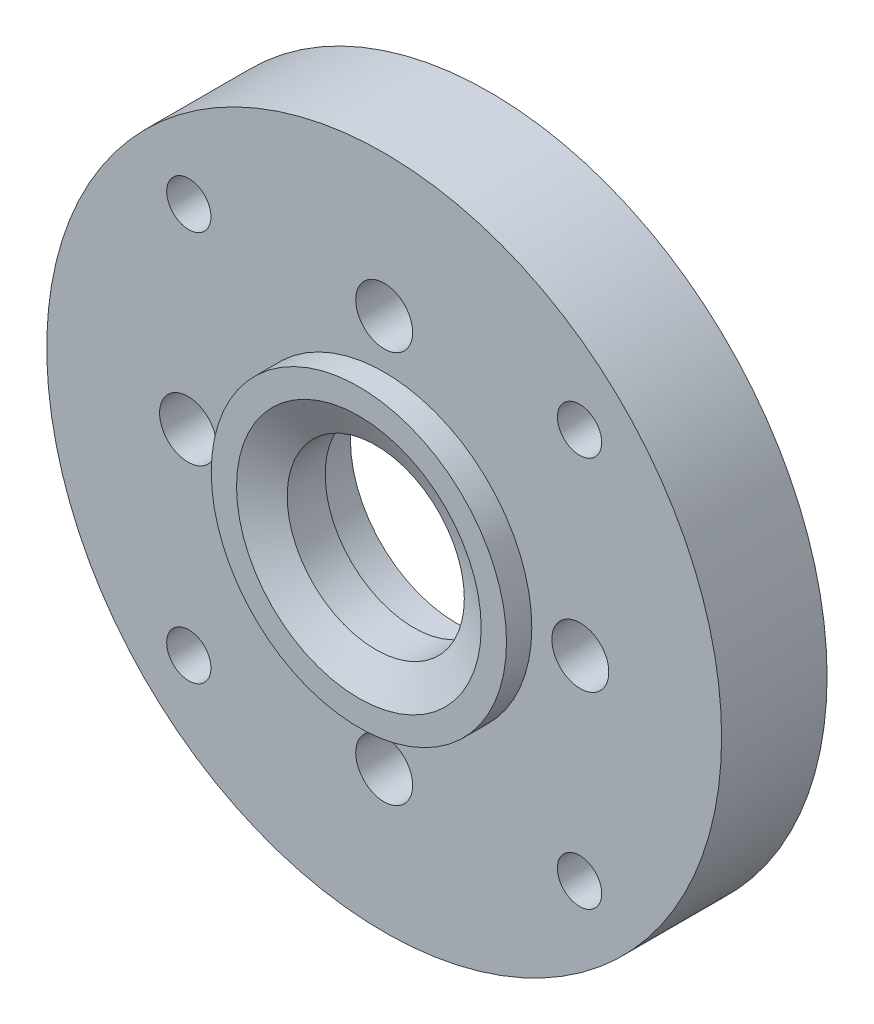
ISO-10303-21;
HEADER;
FILE_DESCRIPTION(('STEP AP214'),'2;1');
FILE_NAME('part.step','',(''),(''),'','','');
FILE_SCHEMA(('AUTOMOTIVE_DESIGN { 1 0 10303 214 1 1 1 1 }'));
ENDSEC;
DATA;
#1=APPLICATION_CONTEXT('core data for automotive mechanical design processes');
#2=APPLICATION_PROTOCOL_DEFINITION('international standard','automotive_design',2000,#1);
#3=PRODUCT_CONTEXT('',#1,'mechanical');
#4=PRODUCT('Part','Part','',(#3));
#5=PRODUCT_RELATED_PRODUCT_CATEGORY('part','',(#4));
#6=PRODUCT_DEFINITION_FORMATION('','',#4);
#7=PRODUCT_DEFINITION_CONTEXT('part definition',#1,'design');
#8=PRODUCT_DEFINITION('design','',#6,#7);
#9=PRODUCT_DEFINITION_SHAPE('','',#8);
#10=(LENGTH_UNIT() NAMED_UNIT(*) SI_UNIT(.MILLI.,.METRE.));
#11=(NAMED_UNIT(*) PLANE_ANGLE_UNIT() SI_UNIT($,.RADIAN.));
#12=(NAMED_UNIT(*) SI_UNIT($,.STERADIAN.) SOLID_ANGLE_UNIT());
#13=UNCERTAINTY_MEASURE_WITH_UNIT(LENGTH_MEASURE(1.E-05),#10,'distance_accuracy_value','');
#14=(GEOMETRIC_REPRESENTATION_CONTEXT(3) GLOBAL_UNCERTAINTY_ASSIGNED_CONTEXT((#13)) GLOBAL_UNIT_ASSIGNED_CONTEXT((#10,
#11,#12)) REPRESENTATION_CONTEXT('',''));
#15=CARTESIAN_POINT('',(0.,0.,0.));
#16=DIRECTION('',(0.,0.,1.));
#17=DIRECTION('',(1.,0.,0.));
#18=AXIS2_PLACEMENT_3D('',#15,#16,#17);
#19=CARTESIAN_POINT('',(0.,0.,9.));
#20=DIRECTION('',(0.,0.,1.));
#21=DIRECTION('',(1.,0.,0.));
#22=AXIS2_PLACEMENT_3D('',#19,#20,#21);
#23=PLANE('',#22);
#24=CARTESIAN_POINT('',(0.,0.,9.));
#25=DIRECTION('',(0.,0.,1.));
#26=DIRECTION('',(1.,0.,0.));
#27=AXIS2_PLACEMENT_3D('',#24,#25,#26);
#28=CIRCLE('',#27,10.5);
#29=CARTESIAN_POINT('',(10.5,0.,9.));
#30=VERTEX_POINT('',#29);
#31=EDGE_CURVE('E21',#30,#30,#28,.T.);
#32=ORIENTED_EDGE('',*,*,#31,.T.);
#33=EDGE_LOOP('',(#32));
#34=FACE_BOUND('',#33,.T.);
#35=CARTESIAN_POINT('',(0.,0.,9.));
#36=DIRECTION('',(0.,0.,1.));
#37=DIRECTION('',(1.,0.,0.));
#38=AXIS2_PLACEMENT_3D('',#35,#36,#37);
#39=CIRCLE('',#38,12.5);
#40=CARTESIAN_POINT('',(12.5,0.,9.));
#41=VERTEX_POINT('',#40);
#42=EDGE_CURVE('E136',#41,#41,#39,.F.);
#43=ORIENTED_EDGE('',*,*,#42,.T.);
#44=EDGE_LOOP('',(#43));
#45=FACE_BOUND('',#44,.T.);
#46=ADVANCED_FACE('F17',(#34,#45),#23,.F.);
#47=CARTESIAN_POINT('',(0.,0.,4.));
#48=DIRECTION('',(0.,0.,1.));
#49=DIRECTION('',(1.,0.,0.));
#50=AXIS2_PLACEMENT_3D('',#47,#48,#49);
#51=CYLINDRICAL_SURFACE('',#50,10.5);
#52=ORIENTED_EDGE('',*,*,#31,.F.);
#53=EDGE_LOOP('',(#52));
#54=FACE_BOUND('',#53,.T.);
#55=CARTESIAN_POINT('',(0.,0.,13.5));
#56=DIRECTION('',(0.,0.,1.));
#57=DIRECTION('',(0.,-1.,0.));
#58=AXIS2_PLACEMENT_3D('',#55,#56,#57);
#59=CIRCLE('',#58,10.5);
#60=CARTESIAN_POINT('',(0.,-10.5,13.5));
#61=VERTEX_POINT('',#60);
#62=EDGE_CURVE('E134',#61,#61,#59,.T.);
#63=ORIENTED_EDGE('',*,*,#62,.T.);
#64=EDGE_LOOP('',(#63));
#65=FACE_BOUND('',#64,.T.);
#66=ADVANCED_FACE('F223',(#54,#65),#51,.F.);
#67=CARTESIAN_POINT('',(0.,0.,4.));
#68=DIRECTION('',(0.,0.,1.));
#69=DIRECTION('',(1.,0.,0.));
#70=AXIS2_PLACEMENT_3D('',#67,#68,#69);
#71=CYLINDRICAL_SURFACE('',#70,12.5);
#72=ORIENTED_EDGE('',*,*,#42,.F.);
#73=EDGE_LOOP('',(#72));
#74=FACE_BOUND('',#73,.T.);
#75=CARTESIAN_POINT('',(0.,0.,4.));
#76=DIRECTION('',(0.,0.,1.));
#77=DIRECTION('',(1.,0.,0.));
#78=AXIS2_PLACEMENT_3D('',#75,#76,#77);
#79=CIRCLE('',#78,12.5);
#80=CARTESIAN_POINT('',(12.5,0.,4.));
#81=VERTEX_POINT('',#80);
#82=EDGE_CURVE('E109',#81,#81,#79,.F.);
#83=ORIENTED_EDGE('',*,*,#82,.T.);
#84=EDGE_LOOP('',(#83));
#85=FACE_BOUND('',#84,.T.);
#86=ADVANCED_FACE('F226',(#74,#85),#71,.F.);
#87=CARTESIAN_POINT('',(0.,0.,15.5000000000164));
#88=DIRECTION('',(0.,0.,1.));
#89=DIRECTION('',(1.,0.,0.));
#90=AXIS2_PLACEMENT_3D('',#87,#88,#89);
#91=CONICAL_SURFACE('',#90,14.4999999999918,1.10714871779);
#92=ORIENTED_EDGE('',*,*,#62,.F.);
#93=EDGE_LOOP('',(#92));
#94=FACE_BOUND('',#93,.T.);
#95=CARTESIAN_POINT('',(0.,0.,15.5000000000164));
#96=DIRECTION('',(0.,0.,1.));
#97=DIRECTION('',(1.,0.,0.));
#98=AXIS2_PLACEMENT_3D('',#95,#96,#97);
#99=CIRCLE('',#98,14.4999999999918);
#100=CARTESIAN_POINT('',(14.4999999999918,0.,15.5000000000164));
#101=VERTEX_POINT('',#100);
#102=EDGE_CURVE('E133',#101,#101,#99,.T.);
#103=ORIENTED_EDGE('',*,*,#102,.T.);
#104=EDGE_LOOP('',(#103));
#105=FACE_BOUND('',#104,.T.);
#106=ADVANCED_FACE('F230',(#94,#105),#91,.F.);
#107=CARTESIAN_POINT('',(0.,0.,4.));
#108=DIRECTION('',(0.,0.,1.));
#109=DIRECTION('',(1.,0.,0.));
#110=AXIS2_PLACEMENT_3D('',#107,#108,#109);
#111=PLANE('',#110);
#112=ORIENTED_EDGE('',*,*,#82,.F.);
#113=EDGE_LOOP('',(#112));
#114=FACE_BOUND('',#113,.T.);
#115=CARTESIAN_POINT('',(-23.25,0.,3.99999999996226));
#116=DIRECTION('',(0.,0.,-1.));
#117=DIRECTION('',(-1.,0.,0.));
#118=AXIS2_PLACEMENT_3D('',#115,#116,#117);
#119=CIRCLE('',#118,6.00000000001);
#120=CARTESIAN_POINT('',(-24.2916666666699,-5.90888572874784,3.99999999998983));
#121=VERTEX_POINT('',#120);
#122=CARTESIAN_POINT('',(-24.291666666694,5.90888572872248,4.00000000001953));
#123=VERTEX_POINT('',#122);
#124=EDGE_CURVE('E84',#121,#123,#119,.F.);
#125=ORIENTED_EDGE('',*,*,#124,.T.);
#126=CARTESIAN_POINT('',(0.,0.,4.00000000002));
#127=DIRECTION('',(0.,0.,1.));
#128=DIRECTION('',(1.,0.,0.));
#129=AXIS2_PLACEMENT_3D('',#126,#127,#128);
#130=CIRCLE('',#129,25.);
#131=CARTESIAN_POINT('',(-5.90888572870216,24.291666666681,4.00000000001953));
#132=VERTEX_POINT('',#131);
#133=EDGE_CURVE('E95',#123,#132,#130,.F.);
#134=ORIENTED_EDGE('',*,*,#133,.T.);
#135=CARTESIAN_POINT('',(0.,23.25,4.0000000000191));
#136=DIRECTION('',(0.,0.,-1.));
#137=DIRECTION('',(-1.,0.,0.));
#138=AXIS2_PLACEMENT_3D('',#135,#136,#137);
#139=CIRCLE('',#138,5.99999999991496);
#140=CARTESIAN_POINT('',(5.90888572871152,24.2916666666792,4.00000000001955));
#141=VERTEX_POINT('',#140);
#142=EDGE_CURVE('E122',#132,#141,#139,.F.);
#143=ORIENTED_EDGE('',*,*,#142,.T.);
#144=CARTESIAN_POINT('',(0.,0.,4.00000000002));
#145=DIRECTION('',(0.,0.,1.));
#146=DIRECTION('',(1.,0.,0.));
#147=AXIS2_PLACEMENT_3D('',#144,#145,#146);
#148=CIRCLE('',#147,25.);
#149=CARTESIAN_POINT('',(24.2916666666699,5.90888572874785,3.99999999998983));
#150=VERTEX_POINT('',#149);
#151=EDGE_CURVE('E205',#141,#150,#148,.F.);
#152=ORIENTED_EDGE('',*,*,#151,.T.);
#153=CARTESIAN_POINT('',(23.25,0.,4.0000000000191));
#154=DIRECTION('',(0.,0.,-1.));
#155=DIRECTION('',(-1.,0.,0.));
#156=AXIS2_PLACEMENT_3D('',#153,#154,#155);
#157=CIRCLE('',#156,5.99999999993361);
#158=CARTESIAN_POINT('',(24.291666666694,-5.90888572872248,4.00000000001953));
#159=VERTEX_POINT('',#158);
#160=EDGE_CURVE('E98',#150,#159,#157,.F.);
#161=ORIENTED_EDGE('',*,*,#160,.T.);
#162=CARTESIAN_POINT('',(0.,0.,4.00000000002));
#163=DIRECTION('',(0.,0.,1.));
#164=DIRECTION('',(1.,0.,0.));
#165=AXIS2_PLACEMENT_3D('',#162,#163,#164);
#166=CIRCLE('',#165,25.);
#167=CARTESIAN_POINT('',(5.90888572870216,-24.291666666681,4.00000000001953));
#168=VERTEX_POINT('',#167);
#169=EDGE_CURVE('E209',#159,#168,#166,.F.);
#170=ORIENTED_EDGE('',*,*,#169,.T.);
#171=CARTESIAN_POINT('',(0.,-23.25,4.0000000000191));
#172=DIRECTION('',(0.,0.,-1.));
#173=DIRECTION('',(-1.,0.,0.));
#174=AXIS2_PLACEMENT_3D('',#171,#172,#173);
#175=CIRCLE('',#174,5.99999999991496);
#176=CARTESIAN_POINT('',(-5.90888572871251,-24.2916666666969,4.00000000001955));
#177=VERTEX_POINT('',#176);
#178=EDGE_CURVE('E89',#168,#177,#175,.F.);
#179=ORIENTED_EDGE('',*,*,#178,.T.);
#180=CARTESIAN_POINT('',(0.,0.,4.00000000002));
#181=DIRECTION('',(0.,0.,1.));
#182=DIRECTION('',(1.,0.,0.));
#183=AXIS2_PLACEMENT_3D('',#180,#181,#182);
#184=CIRCLE('',#183,25.);
#185=EDGE_CURVE('E97',#177,#121,#184,.F.);
#186=ORIENTED_EDGE('',*,*,#185,.T.);
#187=EDGE_LOOP('',(#125,#134,#143,#152,#161,#170,#179,#186));
#188=FACE_BOUND('',#187,.T.);
#189=ADVANCED_FACE('F94',(#114,#188),#111,.F.);
#190=CARTESIAN_POINT('',(0.,23.25,2.));
#191=DIRECTION('',(0.,0.,-1.));
#192=DIRECTION('',(-1.,0.,0.));
#193=AXIS2_PLACEMENT_3D('',#190,#191,#192);
#194=CYLINDRICAL_SURFACE('',#193,6.);
#195=DIRECTION('',(0.,0.,1.));
#196=VECTOR('',#195,1.);
#197=CARTESIAN_POINT('',(5.9088857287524,24.2916666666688,0.));
#198=LINE('',#197,#196);
#199=CARTESIAN_POINT('',(5.90888572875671,24.2916666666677,0.));
#200=VERTEX_POINT('',#199);
#201=EDGE_CURVE('E208',#200,#141,#198,.T.);
#202=ORIENTED_EDGE('',*,*,#201,.T.);
#203=CARTESIAN_POINT('',(0.,23.25,4.0000000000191));
#204=DIRECTION('',(0.,0.,-1.));
#205=DIRECTION('',(-1.,0.,0.));
#206=AXIS2_PLACEMENT_3D('',#203,#204,#205);
#207=CIRCLE('',#206,5.99999999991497);
#208=EDGE_CURVE('E120',#141,#132,#207,.F.);
#209=ORIENTED_EDGE('',*,*,#208,.T.);
#210=DIRECTION('',(0.,0.,1.));
#211=VECTOR('',#210,1.);
#212=CARTESIAN_POINT('',(-5.90888572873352,24.2916666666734,0.));
#213=LINE('',#212,#211);
#214=CARTESIAN_POINT('',(-5.90888572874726,24.29166666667,0.));
#215=VERTEX_POINT('',#214);
#216=EDGE_CURVE('E107',#132,#215,#213,.F.);
#217=ORIENTED_EDGE('',*,*,#216,.T.);
#218=CARTESIAN_POINT('',(0.,23.25,0.));
#219=DIRECTION('',(0.,0.,-1.));
#220=DIRECTION('',(-1.,0.,0.));
#221=AXIS2_PLACEMENT_3D('',#218,#219,#220);
#222=CIRCLE('',#221,6.);
#223=EDGE_CURVE('E196',#200,#215,#222,.F.);
#224=ORIENTED_EDGE('',*,*,#223,.F.);
#225=EDGE_LOOP('',(#202,#209,#217,#224));
#226=FACE_BOUND('',#225,.T.);
#227=ADVANCED_FACE('F463',(#226),#194,.F.);
#228=CARTESIAN_POINT('',(0.,0.,0.));
#229=DIRECTION('',(0.,0.,1.));
#230=DIRECTION('',(1.,0.,0.));
#231=AXIS2_PLACEMENT_3D('',#228,#229,#230);
#232=CYLINDRICAL_SURFACE('',#231,25.);
#233=ORIENTED_EDGE('',*,*,#216,.F.);
#234=ORIENTED_EDGE('',*,*,#133,.F.);
#235=DIRECTION('',(0.,0.,-1.));
#236=VECTOR('',#235,1.);
#237=CARTESIAN_POINT('',(-24.2916666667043,5.90888572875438,2.));
#238=LINE('',#237,#236);
#239=CARTESIAN_POINT('',(-24.2916666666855,5.9088857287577,0.));
#240=VERTEX_POINT('',#239);
#241=EDGE_CURVE('E105',#123,#240,#238,.T.);
#242=ORIENTED_EDGE('',*,*,#241,.T.);
#243=CARTESIAN_POINT('',(0.,0.,0.));
#244=DIRECTION('',(0.,0.,1.));
#245=DIRECTION('',(1.,0.,0.));
#246=AXIS2_PLACEMENT_3D('',#243,#244,#245);
#247=CIRCLE('',#246,25.);
#248=EDGE_CURVE('E194',#215,#240,#247,.T.);
#249=ORIENTED_EDGE('',*,*,#248,.F.);
#250=EDGE_LOOP('',(#233,#234,#242,#249));
#251=FACE_BOUND('',#250,.T.);
#252=ADVANCED_FACE('F103',(#251),#232,.F.);
#253=CARTESIAN_POINT('',(-23.25,0.,2.));
#254=DIRECTION('',(0.,0.,-1.));
#255=DIRECTION('',(-1.,0.,0.));
#256=AXIS2_PLACEMENT_3D('',#253,#254,#255);
#257=CYLINDRICAL_SURFACE('',#256,6.);
#258=CARTESIAN_POINT('',(-23.25,0.,3.99999999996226));
#259=DIRECTION('',(0.,0.,-1.));
#260=DIRECTION('',(1.,0.,0.));
#261=AXIS2_PLACEMENT_3D('',#258,#259,#260);
#262=CIRCLE('',#261,6.00000000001);
#263=EDGE_CURVE('E80',#123,#121,#262,.F.);
#264=ORIENTED_EDGE('',*,*,#263,.T.);
#265=DIRECTION('',(0.,0.,1.));
#266=VECTOR('',#265,1.);
#267=CARTESIAN_POINT('',(-24.2916666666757,-5.90888572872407,0.));
#268=LINE('',#267,#266);
#269=CARTESIAN_POINT('',(-24.2916666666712,-5.90888572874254,0.));
#270=VERTEX_POINT('',#269);
#271=EDGE_CURVE('E114',#121,#270,#268,.F.);
#272=ORIENTED_EDGE('',*,*,#271,.T.);
#273=CARTESIAN_POINT('',(-23.25,0.,0.));
#274=DIRECTION('',(0.,0.,-1.));
#275=DIRECTION('',(-1.,0.,0.));
#276=AXIS2_PLACEMENT_3D('',#273,#274,#275);
#277=CIRCLE('',#276,6.);
#278=EDGE_CURVE('E112',#240,#270,#277,.F.);
#279=ORIENTED_EDGE('',*,*,#278,.F.);
#280=ORIENTED_EDGE('',*,*,#241,.F.);
#281=EDGE_LOOP('',(#264,#272,#279,#280));
#282=FACE_BOUND('',#281,.T.);
#283=ADVANCED_FACE('F111',(#282),#257,.F.);
#284=CARTESIAN_POINT('',(0.,0.,0.));
#285=DIRECTION('',(0.,0.,1.));
#286=DIRECTION('',(1.,0.,0.));
#287=AXIS2_PLACEMENT_3D('',#284,#285,#286);
#288=CYLINDRICAL_SURFACE('',#287,25.);
#289=DIRECTION('',(0.,0.,-1.));
#290=VECTOR('',#289,1.);
#291=CARTESIAN_POINT('',(-5.90888572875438,-24.2916666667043,2.));
#292=LINE('',#291,#290);
#293=CARTESIAN_POINT('',(-5.90888572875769,-24.2916666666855,0.));
#294=VERTEX_POINT('',#293);
#295=EDGE_CURVE('E213',#177,#294,#292,.T.);
#296=ORIENTED_EDGE('',*,*,#295,.T.);
#297=CARTESIAN_POINT('',(0.,0.,0.));
#298=DIRECTION('',(0.,0.,1.));
#299=DIRECTION('',(1.,0.,0.));
#300=AXIS2_PLACEMENT_3D('',#297,#298,#299);
#301=CIRCLE('',#300,25.);
#302=EDGE_CURVE('E191',#270,#294,#301,.T.);
#303=ORIENTED_EDGE('',*,*,#302,.F.);
#304=ORIENTED_EDGE('',*,*,#271,.F.);
#305=ORIENTED_EDGE('',*,*,#185,.F.);
#306=EDGE_LOOP('',(#296,#303,#304,#305));
#307=FACE_BOUND('',#306,.T.);
#308=ADVANCED_FACE('F442',(#307),#288,.F.);
#309=CARTESIAN_POINT('',(0.,-23.25,2.));
#310=DIRECTION('',(0.,0.,-1.));
#311=DIRECTION('',(-1.,0.,0.));
#312=AXIS2_PLACEMENT_3D('',#309,#310,#311);
#313=CYLINDRICAL_SURFACE('',#312,6.);
#314=DIRECTION('',(0.,0.,1.));
#315=VECTOR('',#314,1.);
#316=CARTESIAN_POINT('',(5.90888572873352,-24.2916666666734,0.));
#317=LINE('',#316,#315);
#318=CARTESIAN_POINT('',(5.90888572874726,-24.29166666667,0.));
#319=VERTEX_POINT('',#318);
#320=EDGE_CURVE('E212',#168,#319,#317,.F.);
#321=ORIENTED_EDGE('',*,*,#320,.T.);
#322=CARTESIAN_POINT('',(0.,-23.25,0.));
#323=DIRECTION('',(0.,0.,-1.));
#324=DIRECTION('',(-1.,0.,0.));
#325=AXIS2_PLACEMENT_3D('',#322,#323,#324);
#326=CIRCLE('',#325,6.);
#327=EDGE_CURVE('E189',#294,#319,#326,.F.);
#328=ORIENTED_EDGE('',*,*,#327,.F.);
#329=ORIENTED_EDGE('',*,*,#295,.F.);
#330=CARTESIAN_POINT('',(0.,-23.25,4.0000000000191));
#331=DIRECTION('',(0.,0.,-1.));
#332=DIRECTION('',(1.,0.,0.));
#333=AXIS2_PLACEMENT_3D('',#330,#331,#332);
#334=CIRCLE('',#333,5.99999999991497);
#335=EDGE_CURVE('E130',#177,#168,#334,.F.);
#336=ORIENTED_EDGE('',*,*,#335,.T.);
#337=EDGE_LOOP('',(#321,#328,#329,#336));
#338=FACE_BOUND('',#337,.T.);
#339=ADVANCED_FACE('F434',(#338),#313,.F.);
#340=CARTESIAN_POINT('',(0.,0.,0.));
#341=DIRECTION('',(0.,0.,1.));
#342=DIRECTION('',(1.,0.,0.));
#343=AXIS2_PLACEMENT_3D('',#340,#341,#342);
#344=CYLINDRICAL_SURFACE('',#343,25.);
#345=ORIENTED_EDGE('',*,*,#320,.F.);
#346=ORIENTED_EDGE('',*,*,#169,.F.);
#347=DIRECTION('',(0.,0.,-1.));
#348=VECTOR('',#347,1.);
#349=CARTESIAN_POINT('',(24.2916666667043,-5.90888572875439,2.));
#350=LINE('',#349,#348);
#351=CARTESIAN_POINT('',(24.2916666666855,-5.9088857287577,0.));
#352=VERTEX_POINT('',#351);
#353=EDGE_CURVE('E507',#159,#352,#350,.T.);
#354=ORIENTED_EDGE('',*,*,#353,.T.);
#355=CARTESIAN_POINT('',(0.,0.,0.));
#356=DIRECTION('',(0.,0.,1.));
#357=DIRECTION('',(1.,0.,0.));
#358=AXIS2_PLACEMENT_3D('',#355,#356,#357);
#359=CIRCLE('',#358,25.);
#360=EDGE_CURVE('E187',#319,#352,#359,.T.);
#361=ORIENTED_EDGE('',*,*,#360,.F.);
#362=EDGE_LOOP('',(#345,#346,#354,#361));
#363=FACE_BOUND('',#362,.T.);
#364=ADVANCED_FACE('F426',(#363),#344,.F.);
#365=CARTESIAN_POINT('',(23.25,0.,2.));
#366=DIRECTION('',(0.,0.,-1.));
#367=DIRECTION('',(-1.,0.,0.));
#368=AXIS2_PLACEMENT_3D('',#365,#366,#367);
#369=CYLINDRICAL_SURFACE('',#368,6.);
#370=DIRECTION('',(0.,0.,1.));
#371=VECTOR('',#370,1.);
#372=CARTESIAN_POINT('',(24.2916666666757,5.90888572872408,0.));
#373=LINE('',#372,#371);
#374=CARTESIAN_POINT('',(24.2916666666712,5.90888572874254,0.));
#375=VERTEX_POINT('',#374);
#376=EDGE_CURVE('E204',#150,#375,#373,.F.);
#377=ORIENTED_EDGE('',*,*,#376,.T.);
#378=CARTESIAN_POINT('',(23.25,0.,0.));
#379=DIRECTION('',(0.,0.,-1.));
#380=DIRECTION('',(-1.,0.,0.));
#381=AXIS2_PLACEMENT_3D('',#378,#379,#380);
#382=CIRCLE('',#381,6.);
#383=EDGE_CURVE('E36',#352,#375,#382,.F.);
#384=ORIENTED_EDGE('',*,*,#383,.F.);
#385=ORIENTED_EDGE('',*,*,#353,.F.);
#386=CARTESIAN_POINT('',(23.25,0.,4.0000000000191));
#387=DIRECTION('',(0.,0.,-1.));
#388=DIRECTION('',(1.,0.,0.));
#389=AXIS2_PLACEMENT_3D('',#386,#387,#388);
#390=CIRCLE('',#389,5.99999999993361);
#391=EDGE_CURVE('E123',#159,#150,#390,.F.);
#392=ORIENTED_EDGE('',*,*,#391,.T.);
#393=EDGE_LOOP('',(#377,#384,#385,#392));
#394=FACE_BOUND('',#393,.T.);
#395=ADVANCED_FACE('F418',(#394),#369,.F.);
#396=CARTESIAN_POINT('',(0.,0.,0.));
#397=DIRECTION('',(0.,0.,1.));
#398=DIRECTION('',(1.,0.,0.));
#399=AXIS2_PLACEMENT_3D('',#396,#397,#398);
#400=CYLINDRICAL_SURFACE('',#399,25.);
#401=ORIENTED_EDGE('',*,*,#376,.F.);
#402=ORIENTED_EDGE('',*,*,#151,.F.);
#403=ORIENTED_EDGE('',*,*,#201,.F.);
#404=CARTESIAN_POINT('',(0.,0.,0.));
#405=DIRECTION('',(0.,0.,1.));
#406=DIRECTION('',(1.,0.,0.));
#407=AXIS2_PLACEMENT_3D('',#404,#405,#406);
#408=CIRCLE('',#407,25.);
#409=EDGE_CURVE('E184',#375,#200,#408,.T.);
#410=ORIENTED_EDGE('',*,*,#409,.F.);
#411=EDGE_LOOP('',(#401,#402,#403,#410));
#412=FACE_BOUND('',#411,.T.);
#413=ADVANCED_FACE('F240',(#412),#400,.F.);
#414=CARTESIAN_POINT('',(0.,0.,15.5));
#415=DIRECTION('',(0.,0.,-1.));
#416=DIRECTION('',(-1.,0.,0.));
#417=AXIS2_PLACEMENT_3D('',#414,#415,#416);
#418=PLANE('',#417);
#419=ORIENTED_EDGE('',*,*,#102,.F.);
#420=EDGE_LOOP('',(#419));
#421=FACE_BOUND('',#420,.T.);
#422=CARTESIAN_POINT('',(0.,0.,15.5));
#423=DIRECTION('',(0.,0.,1.));
#424=DIRECTION('',(1.,0.,0.));
#425=AXIS2_PLACEMENT_3D('',#422,#423,#424);
#426=CIRCLE('',#425,17.5);
#427=CARTESIAN_POINT('',(17.5,0.,15.5));
#428=VERTEX_POINT('',#427);
#429=EDGE_CURVE('E177',#428,#428,#426,.F.);
#430=ORIENTED_EDGE('',*,*,#429,.F.);
#431=EDGE_LOOP('',(#430));
#432=FACE_BOUND('',#431,.T.);
#433=ADVANCED_FACE('F236',(#421,#432),#418,.F.);
#434=CARTESIAN_POINT('',(0.,-23.25,4.0000000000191));
#435=DIRECTION('',(0.,0.,-1.));
#436=DIRECTION('',(-1.,0.,0.));
#437=AXIS2_PLACEMENT_3D('',#434,#435,#436);
#438=CONICAL_SURFACE('',#437,5.99999999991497,1.02974425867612);
#439=ORIENTED_EDGE('',*,*,#335,.F.);
#440=ORIENTED_EDGE('',*,*,#178,.F.);
#441=EDGE_LOOP('',(#439,#440));
#442=FACE_BOUND('',#441,.T.);
#443=CARTESIAN_POINT('',(0.,-23.25,5.57725912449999));
#444=DIRECTION('',(0.,0.,-1.));
#445=DIRECTION('',(-1.,0.,0.));
#446=AXIS2_PLACEMENT_3D('',#443,#444,#445);
#447=CIRCLE('',#446,3.375);
#448=CARTESIAN_POINT('',(-3.375,-23.25,5.57725912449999));
#449=VERTEX_POINT('',#448);
#450=EDGE_CURVE('E180',#449,#449,#447,.F.);
#451=ORIENTED_EDGE('',*,*,#450,.T.);
#452=EDGE_LOOP('',(#451));
#453=FACE_BOUND('',#452,.T.);
#454=ADVANCED_FACE('F239',(#442,#453),#438,.F.);
#455=CARTESIAN_POINT('',(-23.25,0.,3.99999999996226));
#456=DIRECTION('',(0.,0.,-1.));
#457=DIRECTION('',(-1.,0.,0.));
#458=AXIS2_PLACEMENT_3D('',#455,#456,#457);
#459=CONICAL_SURFACE('',#458,6.00000000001,1.02974425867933);
#460=ORIENTED_EDGE('',*,*,#263,.F.);
#461=ORIENTED_EDGE('',*,*,#124,.F.);
#462=EDGE_LOOP('',(#460,#461));
#463=FACE_BOUND('',#462,.T.);
#464=CARTESIAN_POINT('',(-23.25,0.,5.57725912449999));
#465=DIRECTION('',(0.,0.,-1.));
#466=DIRECTION('',(-1.,0.,0.));
#467=AXIS2_PLACEMENT_3D('',#464,#465,#466);
#468=CIRCLE('',#467,3.375);
#469=CARTESIAN_POINT('',(-26.625,0.,5.57725912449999));
#470=VERTEX_POINT('',#469);
#471=EDGE_CURVE('E529',#470,#470,#468,.F.);
#472=ORIENTED_EDGE('',*,*,#471,.T.);
#473=EDGE_LOOP('',(#472));
#474=FACE_BOUND('',#473,.T.);
#475=ADVANCED_FACE('F82',(#463,#474),#459,.F.);
#476=CARTESIAN_POINT('',(23.25,0.,4.0000000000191));
#477=DIRECTION('',(0.,0.,-1.));
#478=DIRECTION('',(-1.,0.,0.));
#479=AXIS2_PLACEMENT_3D('',#476,#477,#478);
#480=CONICAL_SURFACE('',#479,5.99999999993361,1.02974425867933);
#481=ORIENTED_EDGE('',*,*,#160,.F.);
#482=ORIENTED_EDGE('',*,*,#391,.F.);
#483=EDGE_LOOP('',(#481,#482));
#484=FACE_BOUND('',#483,.T.);
#485=CARTESIAN_POINT('',(23.25,0.,5.57725912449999));
#486=DIRECTION('',(0.,0.,-1.));
#487=DIRECTION('',(-1.,0.,0.));
#488=AXIS2_PLACEMENT_3D('',#485,#486,#487);
#489=CIRCLE('',#488,3.375);
#490=CARTESIAN_POINT('',(19.875,0.,5.57725912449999));
#491=VERTEX_POINT('',#490);
#492=EDGE_CURVE('E526',#491,#491,#489,.F.);
#493=ORIENTED_EDGE('',*,*,#492,.T.);
#494=EDGE_LOOP('',(#493));
#495=FACE_BOUND('',#494,.T.);
#496=ADVANCED_FACE('F387',(#484,#495),#480,.F.);
#497=CARTESIAN_POINT('',(0.,23.25,4.0000000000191));
#498=DIRECTION('',(0.,0.,-1.));
#499=DIRECTION('',(-1.,0.,0.));
#500=AXIS2_PLACEMENT_3D('',#497,#498,#499);
#501=CONICAL_SURFACE('',#500,5.99999999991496,1.02974425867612);
#502=ORIENTED_EDGE('',*,*,#142,.F.);
#503=ORIENTED_EDGE('',*,*,#208,.F.);
#504=EDGE_LOOP('',(#502,#503));
#505=FACE_BOUND('',#504,.T.);
#506=CARTESIAN_POINT('',(0.,23.25,5.57725912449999));
#507=DIRECTION('',(0.,0.,-1.));
#508=DIRECTION('',(-1.,0.,0.));
#509=AXIS2_PLACEMENT_3D('',#506,#507,#508);
#510=CIRCLE('',#509,3.375);
#511=CARTESIAN_POINT('',(-3.37499999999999,23.25,5.57725912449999));
#512=VERTEX_POINT('',#511);
#513=EDGE_CURVE('E176',#512,#512,#510,.F.);
#514=ORIENTED_EDGE('',*,*,#513,.T.);
#515=EDGE_LOOP('',(#514));
#516=FACE_BOUND('',#515,.T.);
#517=ADVANCED_FACE('F266',(#505,#516),#501,.F.);
#518=CARTESIAN_POINT('',(0.,0.,0.));
#519=DIRECTION('',(0.,0.,-1.));
#520=DIRECTION('',(-1.,0.,0.));
#521=AXIS2_PLACEMENT_3D('',#518,#519,#520);
#522=PLANE('',#521);
#523=CARTESIAN_POINT('',(-23.1577470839,23.1577470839,-6.878109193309E-10));
#524=DIRECTION('',(0.,0.,-1.));
#525=DIRECTION('',(-1.,0.,0.));
#526=AXIS2_PLACEMENT_3D('',#523,#524,#525);
#527=CIRCLE('',#526,2.625);
#528=CARTESIAN_POINT('',(-25.7827470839,23.1577470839,-6.878109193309E-10));
#529=VERTEX_POINT('',#528);
#530=EDGE_CURVE('E164',#529,#529,#527,.F.);
#531=ORIENTED_EDGE('',*,*,#530,.T.);
#532=EDGE_LOOP('',(#531));
#533=FACE_BOUND('',#532,.T.);
#534=CARTESIAN_POINT('',(23.1577470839,23.1577470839,-6.878109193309E-10));
#535=DIRECTION('',(0.,0.,-1.));
#536=DIRECTION('',(-1.,0.,0.));
#537=AXIS2_PLACEMENT_3D('',#534,#535,#536);
#538=CIRCLE('',#537,2.625);
#539=CARTESIAN_POINT('',(20.5327470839,23.1577470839,-6.878109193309E-10));
#540=VERTEX_POINT('',#539);
#541=EDGE_CURVE('E167',#540,#540,#538,.F.);
#542=ORIENTED_EDGE('',*,*,#541,.T.);
#543=EDGE_LOOP('',(#542));
#544=FACE_BOUND('',#543,.T.);
#545=CARTESIAN_POINT('',(-23.1577470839,-23.1577470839,-6.878109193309E-10));
#546=DIRECTION('',(0.,0.,-1.));
#547=DIRECTION('',(-1.,0.,0.));
#548=AXIS2_PLACEMENT_3D('',#545,#546,#547);
#549=CIRCLE('',#548,2.625);
#550=CARTESIAN_POINT('',(-25.7827470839,-23.1577470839,-6.878109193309E-10));
#551=VERTEX_POINT('',#550);
#552=EDGE_CURVE('E170',#551,#551,#549,.F.);
#553=ORIENTED_EDGE('',*,*,#552,.T.);
#554=EDGE_LOOP('',(#553));
#555=FACE_BOUND('',#554,.T.);
#556=CARTESIAN_POINT('',(23.1577470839,-23.1577470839,-6.878109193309E-10));
#557=DIRECTION('',(0.,0.,-1.));
#558=DIRECTION('',(-1.,0.,0.));
#559=AXIS2_PLACEMENT_3D('',#556,#557,#558);
#560=CIRCLE('',#559,2.625);
#561=CARTESIAN_POINT('',(20.5327470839,-23.1577470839,-6.878109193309E-10));
#562=VERTEX_POINT('',#561);
#563=EDGE_CURVE('E173',#562,#562,#560,.F.);
#564=ORIENTED_EDGE('',*,*,#563,.T.);
#565=EDGE_LOOP('',(#564));
#566=FACE_BOUND('',#565,.T.);
#567=ORIENTED_EDGE('',*,*,#383,.T.);
#568=ORIENTED_EDGE('',*,*,#409,.T.);
#569=ORIENTED_EDGE('',*,*,#223,.T.);
#570=ORIENTED_EDGE('',*,*,#248,.T.);
#571=ORIENTED_EDGE('',*,*,#278,.T.);
#572=ORIENTED_EDGE('',*,*,#302,.T.);
#573=ORIENTED_EDGE('',*,*,#327,.T.);
#574=ORIENTED_EDGE('',*,*,#360,.T.);
#575=EDGE_LOOP('',(#567,#568,#569,#570,#571,#572,#573,#574));
#576=FACE_BOUND('',#575,.T.);
#577=CARTESIAN_POINT('',(0.,0.,0.));
#578=DIRECTION('',(0.,0.,1.));
#579=DIRECTION('',(1.,0.,0.));
#580=AXIS2_PLACEMENT_3D('',#577,#578,#579);
#581=CIRCLE('',#580,40.);
#582=CARTESIAN_POINT('',(40.,0.,0.));
#583=VERTEX_POINT('',#582);
#584=EDGE_CURVE('E181',#583,#583,#581,.T.);
#585=ORIENTED_EDGE('',*,*,#584,.F.);
#586=EDGE_LOOP('',(#585));
#587=FACE_BOUND('',#586,.T.);
#588=ADVANCED_FACE('F259',(#533,#544,#555,#566,#576,#587),#522,.T.);
#589=CARTESIAN_POINT('',(0.,0.,0.));
#590=DIRECTION('',(0.,0.,1.));
#591=DIRECTION('',(1.,0.,0.));
#592=AXIS2_PLACEMENT_3D('',#589,#590,#591);
#593=CYLINDRICAL_SURFACE('',#592,40.);
#594=ORIENTED_EDGE('',*,*,#584,.T.);
#595=EDGE_LOOP('',(#594));
#596=FACE_BOUND('',#595,.T.);
#597=CARTESIAN_POINT('',(0.,0.,12.5));
#598=DIRECTION('',(0.,0.,1.));
#599=DIRECTION('',(1.,0.,0.));
#600=AXIS2_PLACEMENT_3D('',#597,#598,#599);
#601=CIRCLE('',#600,40.);
#602=CARTESIAN_POINT('',(40.,0.,12.5));
#603=VERTEX_POINT('',#602);
#604=EDGE_CURVE('E161',#603,#603,#601,.F.);
#605=ORIENTED_EDGE('',*,*,#604,.T.);
#606=EDGE_LOOP('',(#605));
#607=FACE_BOUND('',#606,.T.);
#608=ADVANCED_FACE('F248',(#596,#607),#593,.T.);
#609=CARTESIAN_POINT('',(0.,0.,12.5));
#610=DIRECTION('',(0.,0.,1.));
#611=DIRECTION('',(1.,0.,0.));
#612=AXIS2_PLACEMENT_3D('',#609,#610,#611);
#613=CYLINDRICAL_SURFACE('',#612,17.5);
#614=ORIENTED_EDGE('',*,*,#429,.T.);
#615=EDGE_LOOP('',(#614));
#616=FACE_BOUND('',#615,.T.);
#617=CARTESIAN_POINT('',(0.,0.,12.5));
#618=DIRECTION('',(0.,0.,1.));
#619=DIRECTION('',(1.,0.,0.));
#620=AXIS2_PLACEMENT_3D('',#617,#618,#619);
#621=CIRCLE('',#620,17.5);
#622=CARTESIAN_POINT('',(17.5,0.,12.5));
#623=VERTEX_POINT('',#622);
#624=EDGE_CURVE('E158',#623,#623,#621,.T.);
#625=ORIENTED_EDGE('',*,*,#624,.T.);
#626=EDGE_LOOP('',(#625));
#627=FACE_BOUND('',#626,.T.);
#628=ADVANCED_FACE('F244',(#616,#627),#613,.T.);
#629=CARTESIAN_POINT('',(0.,-23.25,114.193914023));
#630=DIRECTION('',(0.,0.,-1.));
#631=DIRECTION('',(-1.,0.,0.));
#632=AXIS2_PLACEMENT_3D('',#629,#630,#631);
#633=CYLINDRICAL_SURFACE('',#632,3.375);
#634=ORIENTED_EDGE('',*,*,#450,.F.);
#635=EDGE_LOOP('',(#634));
#636=FACE_BOUND('',#635,.T.);
#637=CARTESIAN_POINT('',(0.,-23.25,12.4999999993));
#638=DIRECTION('',(0.,0.,-1.));
#639=DIRECTION('',(-1.,0.,0.));
#640=AXIS2_PLACEMENT_3D('',#637,#638,#639);
#641=CIRCLE('',#640,3.375);
#642=CARTESIAN_POINT('',(-3.375,-23.25,12.4999999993));
#643=VERTEX_POINT('',#642);
#644=EDGE_CURVE('E155',#643,#643,#641,.F.);
#645=ORIENTED_EDGE('',*,*,#644,.T.);
#646=EDGE_LOOP('',(#645));
#647=FACE_BOUND('',#646,.T.);
#648=ADVANCED_FACE('F247',(#636,#647),#633,.F.);
#649=CARTESIAN_POINT('',(-23.25,0.,114.193914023));
#650=DIRECTION('',(0.,0.,-1.));
#651=DIRECTION('',(-1.,0.,0.));
#652=AXIS2_PLACEMENT_3D('',#649,#650,#651);
#653=CYLINDRICAL_SURFACE('',#652,3.375);
#654=ORIENTED_EDGE('',*,*,#471,.F.);
#655=EDGE_LOOP('',(#654));
#656=FACE_BOUND('',#655,.T.);
#657=CARTESIAN_POINT('',(-23.25,0.,12.4999999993));
#658=DIRECTION('',(0.,0.,-1.));
#659=DIRECTION('',(-1.,0.,0.));
#660=AXIS2_PLACEMENT_3D('',#657,#658,#659);
#661=CIRCLE('',#660,3.375);
#662=CARTESIAN_POINT('',(-26.625,0.,12.4999999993));
#663=VERTEX_POINT('',#662);
#664=EDGE_CURVE('E152',#663,#663,#661,.F.);
#665=ORIENTED_EDGE('',*,*,#664,.T.);
#666=EDGE_LOOP('',(#665));
#667=FACE_BOUND('',#666,.T.);
#668=ADVANCED_FACE('F273',(#656,#667),#653,.F.);
#669=CARTESIAN_POINT('',(23.25,0.,114.193914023));
#670=DIRECTION('',(0.,0.,-1.));
#671=DIRECTION('',(-1.,0.,0.));
#672=AXIS2_PLACEMENT_3D('',#669,#670,#671);
#673=CYLINDRICAL_SURFACE('',#672,3.375);
#674=ORIENTED_EDGE('',*,*,#492,.F.);
#675=EDGE_LOOP('',(#674));
#676=FACE_BOUND('',#675,.T.);
#677=CARTESIAN_POINT('',(23.25,0.,12.4999999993));
#678=DIRECTION('',(0.,0.,-1.));
#679=DIRECTION('',(-1.,0.,0.));
#680=AXIS2_PLACEMENT_3D('',#677,#678,#679);
#681=CIRCLE('',#680,3.375);
#682=CARTESIAN_POINT('',(19.875,0.,12.4999999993));
#683=VERTEX_POINT('',#682);
#684=EDGE_CURVE('E149',#683,#683,#681,.F.);
#685=ORIENTED_EDGE('',*,*,#684,.T.);
#686=EDGE_LOOP('',(#685));
#687=FACE_BOUND('',#686,.T.);
#688=ADVANCED_FACE('F277',(#676,#687),#673,.F.);
#689=CARTESIAN_POINT('',(0.,23.25,114.193914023));
#690=DIRECTION('',(0.,0.,-1.));
#691=DIRECTION('',(-1.,0.,0.));
#692=AXIS2_PLACEMENT_3D('',#689,#690,#691);
#693=CYLINDRICAL_SURFACE('',#692,3.375);
#694=ORIENTED_EDGE('',*,*,#513,.F.);
#695=EDGE_LOOP('',(#694));
#696=FACE_BOUND('',#695,.T.);
#697=CARTESIAN_POINT('',(0.,23.25,12.4999999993));
#698=DIRECTION('',(0.,0.,-1.));
#699=DIRECTION('',(-1.,0.,0.));
#700=AXIS2_PLACEMENT_3D('',#697,#698,#699);
#701=CIRCLE('',#700,3.375);
#702=CARTESIAN_POINT('',(-3.37499999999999,23.25,12.4999999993));
#703=VERTEX_POINT('',#702);
#704=EDGE_CURVE('E146',#703,#703,#701,.F.);
#705=ORIENTED_EDGE('',*,*,#704,.T.);
#706=EDGE_LOOP('',(#705));
#707=FACE_BOUND('',#706,.T.);
#708=ADVANCED_FACE('F281',(#696,#707),#693,.F.);
#709=CARTESIAN_POINT('',(23.1577470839,-23.1577470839,114.193914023));
#710=DIRECTION('',(0.,0.,-1.));
#711=DIRECTION('',(-1.,0.,0.));
#712=AXIS2_PLACEMENT_3D('',#709,#710,#711);
#713=CYLINDRICAL_SURFACE('',#712,2.625);
#714=ORIENTED_EDGE('',*,*,#563,.F.);
#715=EDGE_LOOP('',(#714));
#716=FACE_BOUND('',#715,.T.);
#717=CARTESIAN_POINT('',(23.1577470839,-23.1577470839,12.4999999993));
#718=DIRECTION('',(0.,0.,-1.));
#719=DIRECTION('',(-1.,0.,0.));
#720=AXIS2_PLACEMENT_3D('',#717,#718,#719);
#721=CIRCLE('',#720,2.625);
#722=CARTESIAN_POINT('',(20.5327470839,-23.1577470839,12.4999999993));
#723=VERTEX_POINT('',#722);
#724=EDGE_CURVE('E143',#723,#723,#721,.F.);
#725=ORIENTED_EDGE('',*,*,#724,.T.);
#726=EDGE_LOOP('',(#725));
#727=FACE_BOUND('',#726,.T.);
#728=ADVANCED_FACE('F285',(#716,#727),#713,.F.);
#729=CARTESIAN_POINT('',(-23.1577470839,-23.1577470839,114.193914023));
#730=DIRECTION('',(0.,0.,-1.));
#731=DIRECTION('',(-1.,0.,0.));
#732=AXIS2_PLACEMENT_3D('',#729,#730,#731);
#733=CYLINDRICAL_SURFACE('',#732,2.625);
#734=ORIENTED_EDGE('',*,*,#552,.F.);
#735=EDGE_LOOP('',(#734));
#736=FACE_BOUND('',#735,.T.);
#737=CARTESIAN_POINT('',(-23.1577470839,-23.1577470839,12.4999999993));
#738=DIRECTION('',(0.,0.,-1.));
#739=DIRECTION('',(-1.,0.,0.));
#740=AXIS2_PLACEMENT_3D('',#737,#738,#739);
#741=CIRCLE('',#740,2.625);
#742=CARTESIAN_POINT('',(-25.7827470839,-23.1577470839,12.4999999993));
#743=VERTEX_POINT('',#742);
#744=EDGE_CURVE('E140',#743,#743,#741,.F.);
#745=ORIENTED_EDGE('',*,*,#744,.T.);
#746=EDGE_LOOP('',(#745));
#747=FACE_BOUND('',#746,.T.);
#748=ADVANCED_FACE('F289',(#736,#747),#733,.F.);
#749=CARTESIAN_POINT('',(23.1577470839,23.1577470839,114.193914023));
#750=DIRECTION('',(0.,0.,-1.));
#751=DIRECTION('',(-1.,0.,0.));
#752=AXIS2_PLACEMENT_3D('',#749,#750,#751);
#753=CYLINDRICAL_SURFACE('',#752,2.625);
#754=ORIENTED_EDGE('',*,*,#541,.F.);
#755=EDGE_LOOP('',(#754));
#756=FACE_BOUND('',#755,.T.);
#757=CARTESIAN_POINT('',(23.1577470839,23.1577470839,12.4999999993));
#758=DIRECTION('',(0.,0.,-1.));
#759=DIRECTION('',(-1.,0.,0.));
#760=AXIS2_PLACEMENT_3D('',#757,#758,#759);
#761=CIRCLE('',#760,2.625);
#762=CARTESIAN_POINT('',(20.5327470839,23.1577470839,12.4999999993));
#763=VERTEX_POINT('',#762);
#764=EDGE_CURVE('E27',#763,#763,#761,.F.);
#765=ORIENTED_EDGE('',*,*,#764,.T.);
#766=EDGE_LOOP('',(#765));
#767=FACE_BOUND('',#766,.T.);
#768=ADVANCED_FACE('F293',(#756,#767),#753,.F.);
#769=CARTESIAN_POINT('',(-23.1577470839,23.1577470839,114.193914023));
#770=DIRECTION('',(0.,0.,-1.));
#771=DIRECTION('',(-1.,0.,0.));
#772=AXIS2_PLACEMENT_3D('',#769,#770,#771);
#773=CYLINDRICAL_SURFACE('',#772,2.625);
#774=ORIENTED_EDGE('',*,*,#530,.F.);
#775=EDGE_LOOP('',(#774));
#776=FACE_BOUND('',#775,.T.);
#777=CARTESIAN_POINT('',(-23.1577470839,23.1577470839,12.4999999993));
#778=DIRECTION('',(0.,0.,-1.));
#779=DIRECTION('',(-1.,0.,0.));
#780=AXIS2_PLACEMENT_3D('',#777,#778,#779);
#781=CIRCLE('',#780,2.625);
#782=CARTESIAN_POINT('',(-25.7827470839,23.1577470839,12.4999999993));
#783=VERTEX_POINT('',#782);
#784=EDGE_CURVE('E11',#783,#783,#781,.F.);
#785=ORIENTED_EDGE('',*,*,#784,.T.);
#786=EDGE_LOOP('',(#785));
#787=FACE_BOUND('',#786,.T.);
#788=ADVANCED_FACE('F254',(#776,#787),#773,.F.);
#789=CARTESIAN_POINT('',(0.,0.,12.5));
#790=DIRECTION('',(0.,0.,-1.));
#791=DIRECTION('',(-1.,0.,0.));
#792=AXIS2_PLACEMENT_3D('',#789,#790,#791);
#793=PLANE('',#792);
#794=ORIENTED_EDGE('',*,*,#784,.F.);
#795=EDGE_LOOP('',(#794));
#796=FACE_BOUND('',#795,.T.);
#797=ORIENTED_EDGE('',*,*,#764,.F.);
#798=EDGE_LOOP('',(#797));
#799=FACE_BOUND('',#798,.T.);
#800=ORIENTED_EDGE('',*,*,#744,.F.);
#801=EDGE_LOOP('',(#800));
#802=FACE_BOUND('',#801,.T.);
#803=ORIENTED_EDGE('',*,*,#724,.F.);
#804=EDGE_LOOP('',(#803));
#805=FACE_BOUND('',#804,.T.);
#806=ORIENTED_EDGE('',*,*,#704,.F.);
#807=EDGE_LOOP('',(#806));
#808=FACE_BOUND('',#807,.T.);
#809=ORIENTED_EDGE('',*,*,#684,.F.);
#810=EDGE_LOOP('',(#809));
#811=FACE_BOUND('',#810,.T.);
#812=ORIENTED_EDGE('',*,*,#664,.F.);
#813=EDGE_LOOP('',(#812));
#814=FACE_BOUND('',#813,.T.);
#815=ORIENTED_EDGE('',*,*,#644,.F.);
#816=EDGE_LOOP('',(#815));
#817=FACE_BOUND('',#816,.T.);
#818=ORIENTED_EDGE('',*,*,#624,.F.);
#819=EDGE_LOOP('',(#818));
#820=FACE_BOUND('',#819,.T.);
#821=ORIENTED_EDGE('',*,*,#604,.F.);
#822=EDGE_LOOP('',(#821));
#823=FACE_BOUND('',#822,.T.);
#824=ADVANCED_FACE('F19',(#796,#799,#802,#805,#808,#811,#814,#817,#820,#823),#793,.F.);
#825=CLOSED_SHELL('',(#46,#66,#86,#106,#189,#227,#252,#283,#308,#339,#364,#395,#413,#433,#454,
#475,#496,#517,#588,#608,#628,#648,#668,#688,#708,#728,#748,#768,#788,#824));
#826=MANIFOLD_SOLID_BREP('B1',#825);
#827=ADVANCED_BREP_SHAPE_REPRESENTATION('',(#18,#826),#14);
#828=SHAPE_DEFINITION_REPRESENTATION(#9,#827);
ENDSEC;
END-ISO-10303-21;
